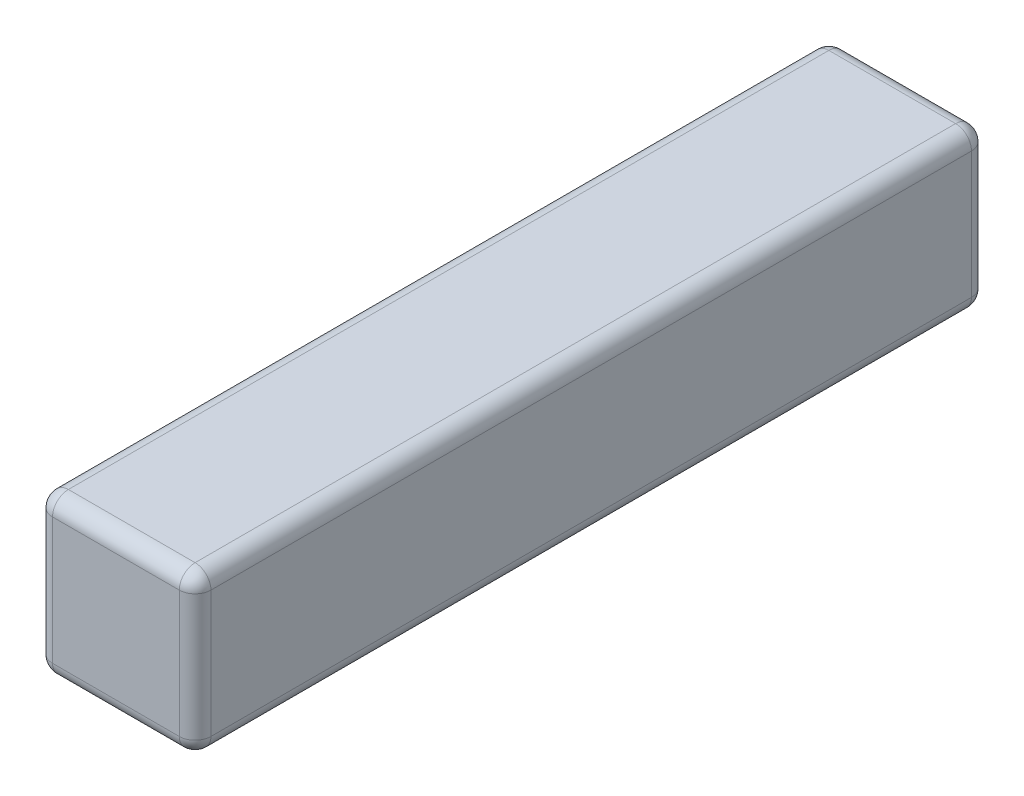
ISO-10303-21;
HEADER;
FILE_DESCRIPTION(('STEP AP214'),'2;1');
FILE_NAME('part.step','',(''),(''),'','','');
FILE_SCHEMA(('AUTOMOTIVE_DESIGN { 1 0 10303 214 1 1 1 1 }'));
ENDSEC;
DATA;
#1=APPLICATION_CONTEXT('core data for automotive mechanical design processes');
#2=APPLICATION_PROTOCOL_DEFINITION('international standard','automotive_design',2000,#1);
#3=PRODUCT_CONTEXT('',#1,'mechanical');
#4=PRODUCT('Part','Part','',(#3));
#5=PRODUCT_RELATED_PRODUCT_CATEGORY('part','',(#4));
#6=PRODUCT_DEFINITION_FORMATION('','',#4);
#7=PRODUCT_DEFINITION_CONTEXT('part definition',#1,'design');
#8=PRODUCT_DEFINITION('design','',#6,#7);
#9=PRODUCT_DEFINITION_SHAPE('','',#8);
#10=(LENGTH_UNIT() NAMED_UNIT(*) SI_UNIT(.MILLI.,.METRE.));
#11=(NAMED_UNIT(*) PLANE_ANGLE_UNIT() SI_UNIT($,.RADIAN.));
#12=(NAMED_UNIT(*) SI_UNIT($,.STERADIAN.) SOLID_ANGLE_UNIT());
#13=UNCERTAINTY_MEASURE_WITH_UNIT(LENGTH_MEASURE(1.E-05),#10,'distance_accuracy_value','');
#14=(GEOMETRIC_REPRESENTATION_CONTEXT(3) GLOBAL_UNCERTAINTY_ASSIGNED_CONTEXT((#13)) GLOBAL_UNIT_ASSIGNED_CONTEXT((#10,
#11,#12)) REPRESENTATION_CONTEXT('',''));
#15=CARTESIAN_POINT('',(0.,0.,0.));
#16=DIRECTION('',(0.,0.,1.));
#17=DIRECTION('',(1.,0.,0.));
#18=AXIS2_PLACEMENT_3D('',#15,#16,#17);
#19=CARTESIAN_POINT('',(1.,-1.,-5.));
#20=DIRECTION('',(1.,0.,0.));
#21=DIRECTION('',(0.,0.,-1.));
#22=AXIS2_PLACEMENT_3D('',#19,#20,#21);
#23=PLANE('',#22);
#24=DIRECTION('',(0.,0.,1.));
#25=VECTOR('',#24,1.);
#26=CARTESIAN_POINT('',(1.,-0.8,-5.));
#27=LINE('',#26,#25);
#28=CARTESIAN_POINT('',(1.,-0.8,4.8));
#29=VERTEX_POINT('',#28);
#30=CARTESIAN_POINT('',(1.,-0.8,-4.8));
#31=VERTEX_POINT('',#30);
#32=EDGE_CURVE('E183',#29,#31,#27,.F.);
#33=ORIENTED_EDGE('',*,*,#32,.T.);
#34=DIRECTION('',(0.,1.,0.));
#35=VECTOR('',#34,1.);
#36=CARTESIAN_POINT('',(1.,-1.,-4.8));
#37=LINE('',#36,#35);
#38=CARTESIAN_POINT('',(1.,0.8,-4.8));
#39=VERTEX_POINT('',#38);
#40=EDGE_CURVE('E185',#31,#39,#37,.T.);
#41=ORIENTED_EDGE('',*,*,#40,.T.);
#42=DIRECTION('',(0.,0.,1.));
#43=VECTOR('',#42,1.);
#44=CARTESIAN_POINT('',(1.,0.8,-5.));
#45=LINE('',#44,#43);
#46=CARTESIAN_POINT('',(1.,0.8,4.8));
#47=VERTEX_POINT('',#46);
#48=EDGE_CURVE('E181',#39,#47,#45,.T.);
#49=ORIENTED_EDGE('',*,*,#48,.T.);
#50=DIRECTION('',(0.,1.,0.));
#51=VECTOR('',#50,1.);
#52=CARTESIAN_POINT('',(1.,-1.,4.8));
#53=LINE('',#52,#51);
#54=EDGE_CURVE('E179',#47,#29,#53,.F.);
#55=ORIENTED_EDGE('',*,*,#54,.T.);
#56=EDGE_LOOP('',(#33,#41,#49,#55));
#57=FACE_BOUND('',#56,.T.);
#58=ADVANCED_FACE('F33',(#57),#23,.T.);
#59=CARTESIAN_POINT('',(-1.,-1.,-5.));
#60=DIRECTION('',(0.,-1.,0.));
#61=DIRECTION('',(0.,0.,-1.));
#62=AXIS2_PLACEMENT_3D('',#59,#60,#61);
#63=PLANE('',#62);
#64=DIRECTION('',(0.,0.,1.));
#65=VECTOR('',#64,1.);
#66=CARTESIAN_POINT('',(-0.8,-1.,-5.));
#67=LINE('',#66,#65);
#68=CARTESIAN_POINT('',(-0.8,-1.,4.8));
#69=VERTEX_POINT('',#68);
#70=CARTESIAN_POINT('',(-0.8,-1.,-4.8));
#71=VERTEX_POINT('',#70);
#72=EDGE_CURVE('E157',#69,#71,#67,.F.);
#73=ORIENTED_EDGE('',*,*,#72,.T.);
#74=DIRECTION('',(1.,0.,0.));
#75=VECTOR('',#74,1.);
#76=CARTESIAN_POINT('',(-1.,-1.,-4.8));
#77=LINE('',#76,#75);
#78=CARTESIAN_POINT('',(0.8,-1.,-4.8));
#79=VERTEX_POINT('',#78);
#80=EDGE_CURVE('E130',#71,#79,#77,.T.);
#81=ORIENTED_EDGE('',*,*,#80,.T.);
#82=DIRECTION('',(0.,0.,1.));
#83=VECTOR('',#82,1.);
#84=CARTESIAN_POINT('',(0.8,-1.,-5.));
#85=LINE('',#84,#83);
#86=CARTESIAN_POINT('',(0.8,-1.,4.8));
#87=VERTEX_POINT('',#86);
#88=EDGE_CURVE('E148',#79,#87,#85,.T.);
#89=ORIENTED_EDGE('',*,*,#88,.T.);
#90=DIRECTION('',(1.,0.,0.));
#91=VECTOR('',#90,1.);
#92=CARTESIAN_POINT('',(-1.,-1.,4.8));
#93=LINE('',#92,#91);
#94=EDGE_CURVE('E153',#87,#69,#93,.F.);
#95=ORIENTED_EDGE('',*,*,#94,.T.);
#96=EDGE_LOOP('',(#73,#81,#89,#95));
#97=FACE_BOUND('',#96,.T.);
#98=ADVANCED_FACE('F155',(#97),#63,.T.);
#99=CARTESIAN_POINT('',(-1.,-1.,-5.));
#100=DIRECTION('',(-1.,0.,0.));
#101=DIRECTION('',(0.,0.,1.));
#102=AXIS2_PLACEMENT_3D('',#99,#100,#101);
#103=PLANE('',#102);
#104=DIRECTION('',(0.,0.,1.));
#105=VECTOR('',#104,1.);
#106=CARTESIAN_POINT('',(-1.,0.8,-5.));
#107=LINE('',#106,#105);
#108=CARTESIAN_POINT('',(-1.,0.8,4.8));
#109=VERTEX_POINT('',#108);
#110=CARTESIAN_POINT('',(-1.,0.8,-4.8));
#111=VERTEX_POINT('',#110);
#112=EDGE_CURVE('E170',#109,#111,#107,.F.);
#113=ORIENTED_EDGE('',*,*,#112,.T.);
#114=DIRECTION('',(0.,-1.,0.));
#115=VECTOR('',#114,1.);
#116=CARTESIAN_POINT('',(-1.,-1.,-4.8));
#117=LINE('',#116,#115);
#118=CARTESIAN_POINT('',(-1.,-0.8,-4.8));
#119=VERTEX_POINT('',#118);
#120=EDGE_CURVE('E176',#111,#119,#117,.T.);
#121=ORIENTED_EDGE('',*,*,#120,.T.);
#122=DIRECTION('',(0.,0.,1.));
#123=VECTOR('',#122,1.);
#124=CARTESIAN_POINT('',(-1.,-0.8,-5.));
#125=LINE('',#124,#123);
#126=CARTESIAN_POINT('',(-1.,-0.8,4.8));
#127=VERTEX_POINT('',#126);
#128=EDGE_CURVE('E174',#119,#127,#125,.T.);
#129=ORIENTED_EDGE('',*,*,#128,.T.);
#130=DIRECTION('',(0.,-1.,0.));
#131=VECTOR('',#130,1.);
#132=CARTESIAN_POINT('',(-1.,1.,4.8));
#133=LINE('',#132,#131);
#134=EDGE_CURVE('E172',#127,#109,#133,.F.);
#135=ORIENTED_EDGE('',*,*,#134,.T.);
#136=EDGE_LOOP('',(#113,#121,#129,#135));
#137=FACE_BOUND('',#136,.T.);
#138=ADVANCED_FACE('F270',(#137),#103,.T.);
#139=CARTESIAN_POINT('',(-1.,1.,-5.));
#140=DIRECTION('',(0.,1.,0.));
#141=DIRECTION('',(0.,0.,1.));
#142=AXIS2_PLACEMENT_3D('',#139,#140,#141);
#143=PLANE('',#142);
#144=DIRECTION('',(0.,0.,1.));
#145=VECTOR('',#144,1.);
#146=CARTESIAN_POINT('',(0.8,1.,-5.));
#147=LINE('',#146,#145);
#148=CARTESIAN_POINT('',(0.8,1.,4.8));
#149=VERTEX_POINT('',#148);
#150=CARTESIAN_POINT('',(0.8,1.,-4.8));
#151=VERTEX_POINT('',#150);
#152=EDGE_CURVE('E190',#149,#151,#147,.F.);
#153=ORIENTED_EDGE('',*,*,#152,.T.);
#154=DIRECTION('',(-1.,0.,0.));
#155=VECTOR('',#154,1.);
#156=CARTESIAN_POINT('',(-1.,1.,-4.8));
#157=LINE('',#156,#155);
#158=CARTESIAN_POINT('',(-0.8,1.,-4.8));
#159=VERTEX_POINT('',#158);
#160=EDGE_CURVE('E194',#151,#159,#157,.T.);
#161=ORIENTED_EDGE('',*,*,#160,.T.);
#162=DIRECTION('',(0.,0.,1.));
#163=VECTOR('',#162,1.);
#164=CARTESIAN_POINT('',(-0.8,1.,-5.));
#165=LINE('',#164,#163);
#166=CARTESIAN_POINT('',(-0.8,1.,4.8));
#167=VERTEX_POINT('',#166);
#168=EDGE_CURVE('E192',#159,#167,#165,.T.);
#169=ORIENTED_EDGE('',*,*,#168,.T.);
#170=DIRECTION('',(-1.,0.,0.));
#171=VECTOR('',#170,1.);
#172=CARTESIAN_POINT('',(1.,1.,4.8));
#173=LINE('',#172,#171);
#174=EDGE_CURVE('E188',#167,#149,#173,.F.);
#175=ORIENTED_EDGE('',*,*,#174,.T.);
#176=EDGE_LOOP('',(#153,#161,#169,#175));
#177=FACE_BOUND('',#176,.T.);
#178=ADVANCED_FACE('F295',(#177),#143,.T.);
#179=CARTESIAN_POINT('',(0.,0.,-5.));
#180=DIRECTION('',(0.,0.,-1.));
#181=DIRECTION('',(-1.,0.,0.));
#182=AXIS2_PLACEMENT_3D('',#179,#180,#181);
#183=PLANE('',#182);
#184=DIRECTION('',(0.,1.,0.));
#185=VECTOR('',#184,1.);
#186=CARTESIAN_POINT('',(0.8,0.,-5.));
#187=LINE('',#186,#185);
#188=CARTESIAN_POINT('',(0.8,0.8,-5.));
#189=VERTEX_POINT('',#188);
#190=CARTESIAN_POINT('',(0.8,-0.8,-5.));
#191=VERTEX_POINT('',#190);
#192=EDGE_CURVE('E161',#189,#191,#187,.F.);
#193=ORIENTED_EDGE('',*,*,#192,.T.);
#194=DIRECTION('',(1.,0.,0.));
#195=VECTOR('',#194,1.);
#196=CARTESIAN_POINT('',(0.,-0.8,-5.));
#197=LINE('',#196,#195);
#198=CARTESIAN_POINT('',(-0.8,-0.8,-5.));
#199=VERTEX_POINT('',#198);
#200=EDGE_CURVE('E132',#191,#199,#197,.F.);
#201=ORIENTED_EDGE('',*,*,#200,.T.);
#202=DIRECTION('',(0.,-1.,0.));
#203=VECTOR('',#202,1.);
#204=CARTESIAN_POINT('',(-0.8,0.,-5.));
#205=LINE('',#204,#203);
#206=CARTESIAN_POINT('',(-0.8,0.8,-5.));
#207=VERTEX_POINT('',#206);
#208=EDGE_CURVE('E167',#199,#207,#205,.F.);
#209=ORIENTED_EDGE('',*,*,#208,.T.);
#210=DIRECTION('',(-1.,0.,0.));
#211=VECTOR('',#210,1.);
#212=CARTESIAN_POINT('',(0.,0.8,-5.));
#213=LINE('',#212,#211);
#214=EDGE_CURVE('E159',#207,#189,#213,.F.);
#215=ORIENTED_EDGE('',*,*,#214,.T.);
#216=EDGE_LOOP('',(#193,#201,#209,#215));
#217=FACE_BOUND('',#216,.T.);
#218=ADVANCED_FACE('F489',(#217),#183,.T.);
#219=CARTESIAN_POINT('',(0.,0.,5.));
#220=DIRECTION('',(0.,0.,-1.));
#221=DIRECTION('',(-1.,0.,0.));
#222=AXIS2_PLACEMENT_3D('',#219,#220,#221);
#223=PLANE('',#222);
#224=DIRECTION('',(0.,-1.,0.));
#225=VECTOR('',#224,1.);
#226=CARTESIAN_POINT('',(-0.8,-1.,5.));
#227=LINE('',#226,#225);
#228=CARTESIAN_POINT('',(-0.8,0.8,5.));
#229=VERTEX_POINT('',#228);
#230=CARTESIAN_POINT('',(-0.8,-0.8,5.));
#231=VERTEX_POINT('',#230);
#232=EDGE_CURVE('E42',#229,#231,#227,.T.);
#233=ORIENTED_EDGE('',*,*,#232,.T.);
#234=DIRECTION('',(1.,0.,0.));
#235=VECTOR('',#234,1.);
#236=CARTESIAN_POINT('',(1.,-0.8,5.));
#237=LINE('',#236,#235);
#238=CARTESIAN_POINT('',(0.8,-0.8,5.));
#239=VERTEX_POINT('',#238);
#240=EDGE_CURVE('E11',#231,#239,#237,.T.);
#241=ORIENTED_EDGE('',*,*,#240,.T.);
#242=DIRECTION('',(0.,1.,0.));
#243=VECTOR('',#242,1.);
#244=CARTESIAN_POINT('',(0.8,1.,5.));
#245=LINE('',#244,#243);
#246=CARTESIAN_POINT('',(0.8,0.8,5.));
#247=VERTEX_POINT('',#246);
#248=EDGE_CURVE('E199',#239,#247,#245,.T.);
#249=ORIENTED_EDGE('',*,*,#248,.T.);
#250=DIRECTION('',(-1.,0.,0.));
#251=VECTOR('',#250,1.);
#252=CARTESIAN_POINT('',(-1.,0.8,5.));
#253=LINE('',#252,#251);
#254=EDGE_CURVE('E197',#247,#229,#253,.T.);
#255=ORIENTED_EDGE('',*,*,#254,.T.);
#256=EDGE_LOOP('',(#233,#241,#249,#255));
#257=FACE_BOUND('',#256,.T.);
#258=ADVANCED_FACE('F284',(#257),#223,.F.);
#259=CARTESIAN_POINT('',(0.,0.8,4.8));
#260=DIRECTION('',(1.,0.,0.));
#261=DIRECTION('',(0.,0.,-1.));
#262=AXIS2_PLACEMENT_3D('',#259,#260,#261);
#263=CYLINDRICAL_SURFACE('',#262,0.2);
#264=CARTESIAN_POINT('',(-0.8,0.8,4.8));
#265=DIRECTION('',(-1.,0.,0.));
#266=DIRECTION('',(0.,0.,1.));
#267=AXIS2_PLACEMENT_3D('',#264,#265,#266);
#268=CIRCLE('',#267,0.2);
#269=EDGE_CURVE('E37',#229,#167,#268,.T.);
#270=ORIENTED_EDGE('',*,*,#269,.F.);
#271=ORIENTED_EDGE('',*,*,#254,.F.);
#272=CARTESIAN_POINT('',(0.8,0.8,4.8));
#273=DIRECTION('',(1.,0.,0.));
#274=DIRECTION('',(0.,0.,-1.));
#275=AXIS2_PLACEMENT_3D('',#272,#273,#274);
#276=CIRCLE('',#275,0.2);
#277=EDGE_CURVE('E248',#149,#247,#276,.T.);
#278=ORIENTED_EDGE('',*,*,#277,.F.);
#279=ORIENTED_EDGE('',*,*,#174,.F.);
#280=EDGE_LOOP('',(#270,#271,#278,#279));
#281=FACE_BOUND('',#280,.T.);
#282=ADVANCED_FACE('F35',(#281),#263,.T.);
#283=CARTESIAN_POINT('',(-0.8,0.8,4.8));
#284=DIRECTION('',(0.,1.,0.));
#285=DIRECTION('',(0.,0.,1.));
#286=AXIS2_PLACEMENT_3D('',#283,#284,#285);
#287=SPHERICAL_SURFACE('',#286,0.2);
#288=CARTESIAN_POINT('',(-0.8,0.8,4.8));
#289=DIRECTION('',(0.,1.,0.));
#290=DIRECTION('',(0.,0.,1.));
#291=AXIS2_PLACEMENT_3D('',#288,#289,#290);
#292=CIRCLE('',#291,0.2);
#293=EDGE_CURVE('E243',#229,#109,#292,.F.);
#294=ORIENTED_EDGE('',*,*,#293,.F.);
#295=ORIENTED_EDGE('',*,*,#269,.T.);
#296=CARTESIAN_POINT('',(-0.8,0.8,4.8));
#297=DIRECTION('',(0.,0.,1.));
#298=DIRECTION('',(1.,0.,0.));
#299=AXIS2_PLACEMENT_3D('',#296,#297,#298);
#300=CIRCLE('',#299,0.2);
#301=EDGE_CURVE('E246',#109,#167,#300,.F.);
#302=ORIENTED_EDGE('',*,*,#301,.F.);
#303=EDGE_LOOP('',(#294,#295,#302));
#304=FACE_BOUND('',#303,.T.);
#305=ADVANCED_FACE('F259',(#304),#287,.T.);
#306=CARTESIAN_POINT('',(0.8,0.8,4.8));
#307=DIRECTION('',(0.,0.,1.));
#308=DIRECTION('',(1.,0.,0.));
#309=AXIS2_PLACEMENT_3D('',#306,#307,#308);
#310=SPHERICAL_SURFACE('',#309,0.2);
#311=CARTESIAN_POINT('',(0.8,0.8,4.8));
#312=DIRECTION('',(0.,0.,1.));
#313=DIRECTION('',(1.,0.,0.));
#314=AXIS2_PLACEMENT_3D('',#311,#312,#313);
#315=CIRCLE('',#314,0.2);
#316=EDGE_CURVE('E237',#149,#47,#315,.F.);
#317=ORIENTED_EDGE('',*,*,#316,.F.);
#318=ORIENTED_EDGE('',*,*,#277,.T.);
#319=CARTESIAN_POINT('',(0.8,0.8,4.8));
#320=DIRECTION('',(0.,1.,0.));
#321=DIRECTION('',(-1.,0.,0.));
#322=AXIS2_PLACEMENT_3D('',#319,#320,#321);
#323=CIRCLE('',#322,0.2);
#324=EDGE_CURVE('E240',#47,#247,#323,.F.);
#325=ORIENTED_EDGE('',*,*,#324,.F.);
#326=EDGE_LOOP('',(#317,#318,#325));
#327=FACE_BOUND('',#326,.T.);
#328=ADVANCED_FACE('F287',(#327),#310,.T.);
#329=CARTESIAN_POINT('',(-0.8,0.8,-5.));
#330=DIRECTION('',(0.,0.,1.));
#331=DIRECTION('',(1.,0.,0.));
#332=AXIS2_PLACEMENT_3D('',#329,#330,#331);
#333=CYLINDRICAL_SURFACE('',#332,0.2);
#334=ORIENTED_EDGE('',*,*,#301,.T.);
#335=ORIENTED_EDGE('',*,*,#168,.F.);
#336=CARTESIAN_POINT('',(-0.8,0.8,-4.8));
#337=DIRECTION('',(0.,0.,-1.));
#338=DIRECTION('',(-1.,0.,0.));
#339=AXIS2_PLACEMENT_3D('',#336,#337,#338);
#340=CIRCLE('',#339,0.2);
#341=EDGE_CURVE('E232',#111,#159,#340,.T.);
#342=ORIENTED_EDGE('',*,*,#341,.F.);
#343=ORIENTED_EDGE('',*,*,#112,.F.);
#344=EDGE_LOOP('',(#334,#335,#342,#343));
#345=FACE_BOUND('',#344,.T.);
#346=ADVANCED_FACE('F266',(#345),#333,.T.);
#347=CARTESIAN_POINT('',(-0.8,0.,4.8));
#348=DIRECTION('',(0.,1.,0.));
#349=DIRECTION('',(0.,0.,1.));
#350=AXIS2_PLACEMENT_3D('',#347,#348,#349);
#351=CYLINDRICAL_SURFACE('',#350,0.2);
#352=ORIENTED_EDGE('',*,*,#293,.T.);
#353=ORIENTED_EDGE('',*,*,#134,.F.);
#354=CARTESIAN_POINT('',(-0.8,-0.8,4.8));
#355=DIRECTION('',(0.,-1.,0.));
#356=DIRECTION('',(0.,0.,-1.));
#357=AXIS2_PLACEMENT_3D('',#354,#355,#356);
#358=CIRCLE('',#357,0.2);
#359=EDGE_CURVE('E229',#231,#127,#358,.T.);
#360=ORIENTED_EDGE('',*,*,#359,.F.);
#361=ORIENTED_EDGE('',*,*,#232,.F.);
#362=EDGE_LOOP('',(#352,#353,#360,#361));
#363=FACE_BOUND('',#362,.T.);
#364=ADVANCED_FACE('F276',(#363),#351,.T.);
#365=CARTESIAN_POINT('',(0.,-0.8,4.8));
#366=DIRECTION('',(-1.,0.,0.));
#367=DIRECTION('',(0.,0.,1.));
#368=AXIS2_PLACEMENT_3D('',#365,#366,#367);
#369=CYLINDRICAL_SURFACE('',#368,0.2);
#370=CARTESIAN_POINT('',(0.8,-0.8,4.8));
#371=DIRECTION('',(1.,0.,0.));
#372=DIRECTION('',(0.,1.,0.));
#373=AXIS2_PLACEMENT_3D('',#370,#371,#372);
#374=CIRCLE('',#373,0.2);
#375=EDGE_CURVE('E224',#239,#87,#374,.T.);
#376=ORIENTED_EDGE('',*,*,#375,.F.);
#377=ORIENTED_EDGE('',*,*,#240,.F.);
#378=CARTESIAN_POINT('',(-0.8,-0.8,4.8));
#379=DIRECTION('',(-1.,0.,0.));
#380=DIRECTION('',(0.,0.,1.));
#381=AXIS2_PLACEMENT_3D('',#378,#379,#380);
#382=CIRCLE('',#381,0.2);
#383=EDGE_CURVE('E226',#69,#231,#382,.T.);
#384=ORIENTED_EDGE('',*,*,#383,.F.);
#385=ORIENTED_EDGE('',*,*,#94,.F.);
#386=EDGE_LOOP('',(#376,#377,#384,#385));
#387=FACE_BOUND('',#386,.T.);
#388=ADVANCED_FACE('F282',(#387),#369,.T.);
#389=CARTESIAN_POINT('',(0.8,0.,4.8));
#390=DIRECTION('',(0.,-1.,0.));
#391=DIRECTION('',(0.,0.,-1.));
#392=AXIS2_PLACEMENT_3D('',#389,#390,#391);
#393=CYLINDRICAL_SURFACE('',#392,0.2);
#394=ORIENTED_EDGE('',*,*,#324,.T.);
#395=ORIENTED_EDGE('',*,*,#248,.F.);
#396=CARTESIAN_POINT('',(0.8,-0.8,4.8));
#397=DIRECTION('',(0.,-1.,0.));
#398=DIRECTION('',(0.,0.,-1.));
#399=AXIS2_PLACEMENT_3D('',#396,#397,#398);
#400=CIRCLE('',#399,0.2);
#401=EDGE_CURVE('E56',#29,#239,#400,.T.);
#402=ORIENTED_EDGE('',*,*,#401,.F.);
#403=ORIENTED_EDGE('',*,*,#54,.F.);
#404=EDGE_LOOP('',(#394,#395,#402,#403));
#405=FACE_BOUND('',#404,.T.);
#406=ADVANCED_FACE('F426',(#405),#393,.T.);
#407=CARTESIAN_POINT('',(0.8,0.8,-5.));
#408=DIRECTION('',(0.,0.,1.));
#409=DIRECTION('',(1.,0.,0.));
#410=AXIS2_PLACEMENT_3D('',#407,#408,#409);
#411=CYLINDRICAL_SURFACE('',#410,0.2);
#412=ORIENTED_EDGE('',*,*,#316,.T.);
#413=ORIENTED_EDGE('',*,*,#48,.F.);
#414=CARTESIAN_POINT('',(0.8,0.8,-4.8));
#415=DIRECTION('',(0.,0.,-1.));
#416=DIRECTION('',(-1.,0.,0.));
#417=AXIS2_PLACEMENT_3D('',#414,#415,#416);
#418=CIRCLE('',#417,0.2);
#419=EDGE_CURVE('E220',#151,#39,#418,.T.);
#420=ORIENTED_EDGE('',*,*,#419,.F.);
#421=ORIENTED_EDGE('',*,*,#152,.F.);
#422=EDGE_LOOP('',(#412,#413,#420,#421));
#423=FACE_BOUND('',#422,.T.);
#424=ADVANCED_FACE('F292',(#423),#411,.T.);
#425=CARTESIAN_POINT('',(-1.,0.8,-4.8));
#426=DIRECTION('',(-1.,0.,0.));
#427=DIRECTION('',(0.,0.,1.));
#428=AXIS2_PLACEMENT_3D('',#425,#426,#427);
#429=CYLINDRICAL_SURFACE('',#428,0.2);
#430=CARTESIAN_POINT('',(-0.8,0.8,-4.8));
#431=DIRECTION('',(-1.,0.,0.));
#432=DIRECTION('',(0.,0.,1.));
#433=AXIS2_PLACEMENT_3D('',#430,#431,#432);
#434=CIRCLE('',#433,0.2);
#435=EDGE_CURVE('E234',#159,#207,#434,.T.);
#436=ORIENTED_EDGE('',*,*,#435,.F.);
#437=ORIENTED_EDGE('',*,*,#160,.F.);
#438=CARTESIAN_POINT('',(0.8,0.8,-4.8));
#439=DIRECTION('',(1.,0.,0.));
#440=DIRECTION('',(0.,0.,-1.));
#441=AXIS2_PLACEMENT_3D('',#438,#439,#440);
#442=CIRCLE('',#441,0.2);
#443=EDGE_CURVE('E217',#189,#151,#442,.T.);
#444=ORIENTED_EDGE('',*,*,#443,.F.);
#445=ORIENTED_EDGE('',*,*,#214,.F.);
#446=EDGE_LOOP('',(#436,#437,#444,#445));
#447=FACE_BOUND('',#446,.T.);
#448=ADVANCED_FACE('F299',(#447),#429,.T.);
#449=CARTESIAN_POINT('',(-0.8,0.8,-4.8));
#450=DIRECTION('',(0.,1.,0.));
#451=DIRECTION('',(0.,0.,1.));
#452=AXIS2_PLACEMENT_3D('',#449,#450,#451);
#453=SPHERICAL_SURFACE('',#452,0.2);
#454=ORIENTED_EDGE('',*,*,#341,.T.);
#455=ORIENTED_EDGE('',*,*,#435,.T.);
#456=CARTESIAN_POINT('',(-0.8,0.8,-4.8));
#457=DIRECTION('',(0.,1.,0.));
#458=DIRECTION('',(0.,0.,1.));
#459=AXIS2_PLACEMENT_3D('',#456,#457,#458);
#460=CIRCLE('',#459,0.2);
#461=EDGE_CURVE('E214',#111,#207,#460,.F.);
#462=ORIENTED_EDGE('',*,*,#461,.F.);
#463=EDGE_LOOP('',(#454,#455,#462));
#464=FACE_BOUND('',#463,.T.);
#465=ADVANCED_FACE('F303',(#464),#453,.T.);
#466=CARTESIAN_POINT('',(-0.8,-0.8,4.8));
#467=DIRECTION('',(0.,0.,1.));
#468=DIRECTION('',(1.,0.,0.));
#469=AXIS2_PLACEMENT_3D('',#466,#467,#468);
#470=SPHERICAL_SURFACE('',#469,0.2);
#471=ORIENTED_EDGE('',*,*,#383,.T.);
#472=ORIENTED_EDGE('',*,*,#359,.T.);
#473=CARTESIAN_POINT('',(-0.8,-0.8,4.8));
#474=DIRECTION('',(0.,0.,1.));
#475=DIRECTION('',(1.,0.,0.));
#476=AXIS2_PLACEMENT_3D('',#473,#474,#475);
#477=CIRCLE('',#476,0.2);
#478=EDGE_CURVE('E211',#69,#127,#477,.F.);
#479=ORIENTED_EDGE('',*,*,#478,.F.);
#480=EDGE_LOOP('',(#471,#472,#479));
#481=FACE_BOUND('',#480,.T.);
#482=ADVANCED_FACE('F280',(#481),#470,.T.);
#483=CARTESIAN_POINT('',(0.8,-0.8,4.8));
#484=DIRECTION('',(0.,0.,1.));
#485=DIRECTION('',(1.,0.,0.));
#486=AXIS2_PLACEMENT_3D('',#483,#484,#485);
#487=SPHERICAL_SURFACE('',#486,0.2);
#488=ORIENTED_EDGE('',*,*,#401,.T.);
#489=ORIENTED_EDGE('',*,*,#375,.T.);
#490=CARTESIAN_POINT('',(0.8,-0.8,4.8));
#491=DIRECTION('',(0.,0.,1.));
#492=DIRECTION('',(1.,0.,0.));
#493=AXIS2_PLACEMENT_3D('',#490,#491,#492);
#494=CIRCLE('',#493,0.2);
#495=EDGE_CURVE('E150',#29,#87,#494,.F.);
#496=ORIENTED_EDGE('',*,*,#495,.F.);
#497=EDGE_LOOP('',(#488,#489,#496));
#498=FACE_BOUND('',#497,.T.);
#499=ADVANCED_FACE('F384',(#498),#487,.T.);
#500=CARTESIAN_POINT('',(0.8,0.8,-4.8));
#501=DIRECTION('',(0.,1.,0.));
#502=DIRECTION('',(0.,0.,1.));
#503=AXIS2_PLACEMENT_3D('',#500,#501,#502);
#504=SPHERICAL_SURFACE('',#503,0.2);
#505=ORIENTED_EDGE('',*,*,#443,.T.);
#506=ORIENTED_EDGE('',*,*,#419,.T.);
#507=CARTESIAN_POINT('',(0.8,0.8,-4.8));
#508=DIRECTION('',(0.,1.,0.));
#509=DIRECTION('',(0.,0.,1.));
#510=AXIS2_PLACEMENT_3D('',#507,#508,#509);
#511=CIRCLE('',#510,0.2);
#512=EDGE_CURVE('E208',#189,#39,#511,.F.);
#513=ORIENTED_EDGE('',*,*,#512,.F.);
#514=EDGE_LOOP('',(#505,#506,#513));
#515=FACE_BOUND('',#514,.T.);
#516=ADVANCED_FACE('F375',(#515),#504,.T.);
#517=CARTESIAN_POINT('',(-0.8,-1.,-4.8));
#518=DIRECTION('',(0.,-1.,0.));
#519=DIRECTION('',(0.,0.,-1.));
#520=AXIS2_PLACEMENT_3D('',#517,#518,#519);
#521=CYLINDRICAL_SURFACE('',#520,0.2);
#522=ORIENTED_EDGE('',*,*,#461,.T.);
#523=ORIENTED_EDGE('',*,*,#208,.F.);
#524=CARTESIAN_POINT('',(-0.8,-0.8,-4.8));
#525=DIRECTION('',(0.,-1.,0.));
#526=DIRECTION('',(0.,0.,-1.));
#527=AXIS2_PLACEMENT_3D('',#524,#525,#526);
#528=CIRCLE('',#527,0.2);
#529=EDGE_CURVE('E205',#119,#199,#528,.T.);
#530=ORIENTED_EDGE('',*,*,#529,.F.);
#531=ORIENTED_EDGE('',*,*,#120,.F.);
#532=EDGE_LOOP('',(#522,#523,#530,#531));
#533=FACE_BOUND('',#532,.T.);
#534=ADVANCED_FACE('F306',(#533),#521,.T.);
#535=CARTESIAN_POINT('',(-0.8,-0.8,-5.));
#536=DIRECTION('',(0.,0.,1.));
#537=DIRECTION('',(1.,0.,0.));
#538=AXIS2_PLACEMENT_3D('',#535,#536,#537);
#539=CYLINDRICAL_SURFACE('',#538,0.2);
#540=ORIENTED_EDGE('',*,*,#478,.T.);
#541=ORIENTED_EDGE('',*,*,#128,.F.);
#542=CARTESIAN_POINT('',(-0.8,-0.8,-4.8));
#543=DIRECTION('',(0.,0.,-1.));
#544=DIRECTION('',(-1.,0.,0.));
#545=AXIS2_PLACEMENT_3D('',#542,#543,#544);
#546=CIRCLE('',#545,0.2);
#547=EDGE_CURVE('E145',#71,#119,#546,.T.);
#548=ORIENTED_EDGE('',*,*,#547,.F.);
#549=ORIENTED_EDGE('',*,*,#72,.F.);
#550=EDGE_LOOP('',(#540,#541,#548,#549));
#551=FACE_BOUND('',#550,.T.);
#552=ADVANCED_FACE('F311',(#551),#539,.T.);
#553=CARTESIAN_POINT('',(0.8,-0.8,-5.));
#554=DIRECTION('',(0.,0.,1.));
#555=DIRECTION('',(1.,0.,0.));
#556=AXIS2_PLACEMENT_3D('',#553,#554,#555);
#557=CYLINDRICAL_SURFACE('',#556,0.2);
#558=ORIENTED_EDGE('',*,*,#495,.T.);
#559=ORIENTED_EDGE('',*,*,#88,.F.);
#560=CARTESIAN_POINT('',(0.8,-0.8,-4.8));
#561=DIRECTION('',(0.,0.,-1.));
#562=DIRECTION('',(-1.,0.,0.));
#563=AXIS2_PLACEMENT_3D('',#560,#561,#562);
#564=CIRCLE('',#563,0.2);
#565=EDGE_CURVE('E138',#31,#79,#564,.T.);
#566=ORIENTED_EDGE('',*,*,#565,.F.);
#567=ORIENTED_EDGE('',*,*,#32,.F.);
#568=EDGE_LOOP('',(#558,#559,#566,#567));
#569=FACE_BOUND('',#568,.T.);
#570=ADVANCED_FACE('F149',(#569),#557,.T.);
#571=CARTESIAN_POINT('',(0.8,-1.,-4.8));
#572=DIRECTION('',(0.,1.,0.));
#573=DIRECTION('',(0.,0.,1.));
#574=AXIS2_PLACEMENT_3D('',#571,#572,#573);
#575=CYLINDRICAL_SURFACE('',#574,0.2);
#576=ORIENTED_EDGE('',*,*,#512,.T.);
#577=ORIENTED_EDGE('',*,*,#40,.F.);
#578=CARTESIAN_POINT('',(0.8,-0.8,-4.8));
#579=DIRECTION('',(0.,-1.,0.));
#580=DIRECTION('',(0.,0.,-1.));
#581=AXIS2_PLACEMENT_3D('',#578,#579,#580);
#582=CIRCLE('',#581,0.2);
#583=EDGE_CURVE('E142',#191,#31,#582,.T.);
#584=ORIENTED_EDGE('',*,*,#583,.F.);
#585=ORIENTED_EDGE('',*,*,#192,.F.);
#586=EDGE_LOOP('',(#576,#577,#584,#585));
#587=FACE_BOUND('',#586,.T.);
#588=ADVANCED_FACE('F314',(#587),#575,.T.);
#589=CARTESIAN_POINT('',(-0.8,-0.8,-4.8));
#590=DIRECTION('',(-1.,0.,0.));
#591=DIRECTION('',(0.,0.,1.));
#592=AXIS2_PLACEMENT_3D('',#589,#590,#591);
#593=SPHERICAL_SURFACE('',#592,0.2);
#594=ORIENTED_EDGE('',*,*,#547,.T.);
#595=ORIENTED_EDGE('',*,*,#529,.T.);
#596=CARTESIAN_POINT('',(-0.8,-0.8,-4.8));
#597=DIRECTION('',(-1.,0.,0.));
#598=DIRECTION('',(0.,0.,1.));
#599=AXIS2_PLACEMENT_3D('',#596,#597,#598);
#600=CIRCLE('',#599,0.2);
#601=EDGE_CURVE('E135',#71,#199,#600,.F.);
#602=ORIENTED_EDGE('',*,*,#601,.F.);
#603=EDGE_LOOP('',(#594,#595,#602));
#604=FACE_BOUND('',#603,.T.);
#605=ADVANCED_FACE('F312',(#604),#593,.T.);
#606=CARTESIAN_POINT('',(0.8,-0.8,-4.8));
#607=DIRECTION('',(1.,0.,0.));
#608=DIRECTION('',(0.,0.,-1.));
#609=AXIS2_PLACEMENT_3D('',#606,#607,#608);
#610=SPHERICAL_SURFACE('',#609,0.2);
#611=ORIENTED_EDGE('',*,*,#583,.T.);
#612=ORIENTED_EDGE('',*,*,#565,.T.);
#613=CARTESIAN_POINT('',(0.8,-0.8,-4.8));
#614=DIRECTION('',(1.,0.,0.));
#615=DIRECTION('',(0.,0.,-1.));
#616=AXIS2_PLACEMENT_3D('',#613,#614,#615);
#617=CIRCLE('',#616,0.2);
#618=EDGE_CURVE('E126',#191,#79,#617,.F.);
#619=ORIENTED_EDGE('',*,*,#618,.F.);
#620=EDGE_LOOP('',(#611,#612,#619));
#621=FACE_BOUND('',#620,.T.);
#622=ADVANCED_FACE('F140',(#621),#610,.T.);
#623=CARTESIAN_POINT('',(-1.,-0.8,-4.8));
#624=DIRECTION('',(1.,0.,0.));
#625=DIRECTION('',(0.,0.,-1.));
#626=AXIS2_PLACEMENT_3D('',#623,#624,#625);
#627=CYLINDRICAL_SURFACE('',#626,0.2);
#628=ORIENTED_EDGE('',*,*,#601,.T.);
#629=ORIENTED_EDGE('',*,*,#200,.F.);
#630=ORIENTED_EDGE('',*,*,#618,.T.);
#631=ORIENTED_EDGE('',*,*,#80,.F.);
#632=EDGE_LOOP('',(#628,#629,#630,#631));
#633=FACE_BOUND('',#632,.T.);
#634=ADVANCED_FACE('F128',(#633),#627,.T.);
#635=CLOSED_SHELL('',(#58,#98,#138,#178,#218,#258,#282,#305,#328,#346,#364,#388,#406,#424,#448,
#465,#482,#499,#516,#534,#552,#570,#588,#605,#622,#634));
#636=MANIFOLD_SOLID_BREP('B2',#635);
#637=ADVANCED_BREP_SHAPE_REPRESENTATION('',(#18,#636),#14);
#638=SHAPE_DEFINITION_REPRESENTATION(#9,#637);
ENDSEC;
END-ISO-10303-21;
